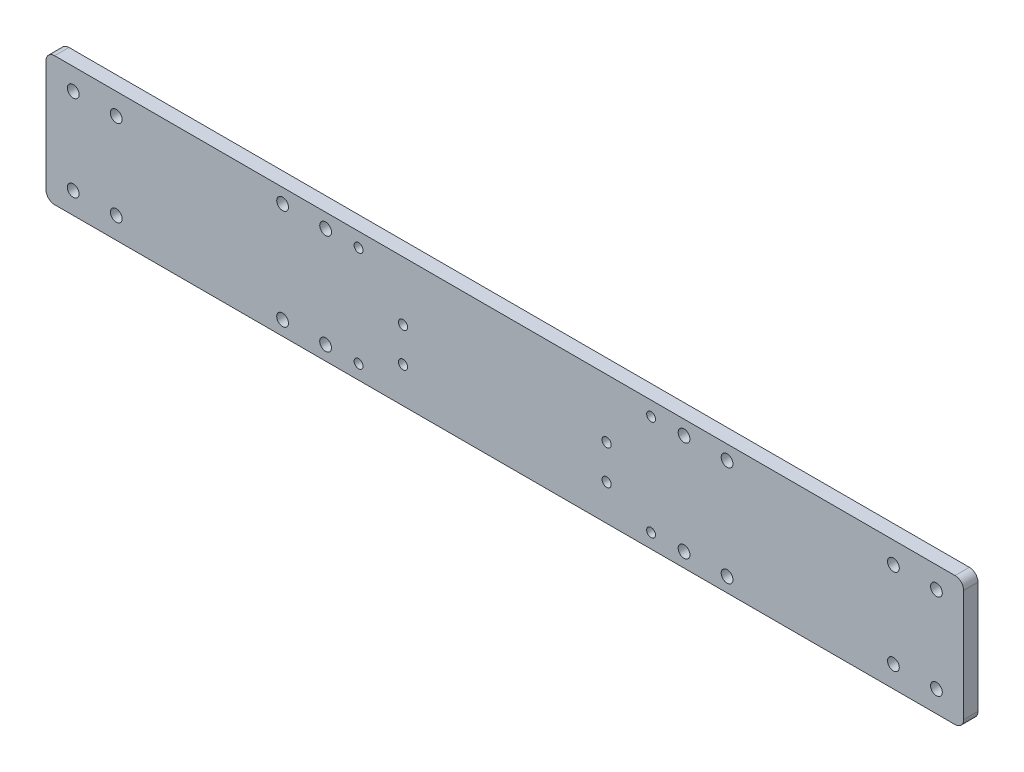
from build123d import *

# Parameters (mm, degrees)
SKETCH_1_R          = 2.05
EXTRUDE_1_DEPTH     = 5
SKETCH_2_R          = 1.55
CUT_EXTRUDE_1_DEPTH = 10
SKETCH_3_R          = 1.6
CUT_EXTRUDE_2_DEPTH = 10
FILLET_1_R          = 3


with BuildPart() as part:
    # Sketch 1 → Extrude 1 (new body)
    with BuildSketch(Plane.XY):
        Polygon((-160, -22.5), (160, -22.5), (160, 22.5), (0, 22.5), (-160, 22.5), align=None)
        with Locations((-77.5, 17.5)):
            Circle(SKETCH_1_R, mode=Mode.SUBTRACT)
        with Locations((-62.5, 17.5)):
            Circle(SKETCH_1_R, mode=Mode.SUBTRACT)
        with Locations((-62.5, -17.5)):
            Circle(SKETCH_1_R, mode=Mode.SUBTRACT)
        with Locations((-77.5, -17.5)):
            Circle(SKETCH_1_R, mode=Mode.SUBTRACT)
        with Locations((-150.5, 15)):
            Circle(SKETCH_1_R, mode=Mode.SUBTRACT)
        with Locations((-135.5, 15)):
            Circle(SKETCH_1_R, mode=Mode.SUBTRACT)
        with Locations((-135.5, -15)):
            Circle(SKETCH_1_R, mode=Mode.SUBTRACT)
        with Locations((-150.5, -15)):
            Circle(SKETCH_1_R, mode=Mode.SUBTRACT)
        with Locations(Location((150.5, 15, 0), (0, 0, 180))):
            Circle(SKETCH_1_R, mode=Mode.SUBTRACT)
        with Locations(Location((150.5, -15, 0), (0, 0, 180))):
            Circle(SKETCH_1_R, mode=Mode.SUBTRACT)
        with Locations(Location((135.5, -15, 0), (0, 0, 180))):
            Circle(SKETCH_1_R, mode=Mode.SUBTRACT)
        with Locations(Location((135.5, 15, 0), (0, 0, 180))):
            Circle(SKETCH_1_R, mode=Mode.SUBTRACT)
        with Locations(Location((62.5, -17.5, 0), (0, 0, 180))):
            Circle(SKETCH_1_R, mode=Mode.SUBTRACT)
        with Locations(Location((77.5, -17.5, 0), (0, 0, 180))):
            Circle(SKETCH_1_R, mode=Mode.SUBTRACT)
        with Locations(Location((62.5, 17.5, 0), (0, 0, 180))):
            Circle(SKETCH_1_R, mode=Mode.SUBTRACT)
        with Locations(Location((77.5, 17.5, 0), (0, 0, 180))):
            Circle(SKETCH_1_R, mode=Mode.SUBTRACT)
    extrude(amount=EXTRUDE_1_DEPTH)

    # Sketch 2 → Cut-Extrude 1 (cut)
    with BuildSketch(Plane.XY.offset(5)):
        with Locations((-51, 17.5)):
            Circle(SKETCH_2_R)
        with Locations((51, 17.5)):
            Circle(SKETCH_2_R)
        with Locations(Location((-51, -17.5, 0), (0, 0, 180))):
            Circle(SKETCH_2_R)
        with Locations(Location((51, -17.5, 0), (0, 0, 180))):
            Circle(SKETCH_2_R)
    extrude(amount=-CUT_EXTRUDE_1_DEPTH, mode=Mode.SUBTRACT)

    # Sketch 3 → Cut-Extrude 2 (cut)
    with BuildSketch(Plane.XY.offset(5)):
        with Locations((-35.5, 2)):
            Circle(SKETCH_3_R)
        with Locations((35.5, 2)):
            Circle(SKETCH_3_R)
        with Locations((35.5, -10)):
            Circle(SKETCH_3_R)
        with Locations((-35.5, -10)):
            Circle(SKETCH_3_R)
    extrude(amount=-CUT_EXTRUDE_2_DEPTH, mode=Mode.SUBTRACT)

    # Fillet 1
    fillet_1_edges = [part.edges().sort_by_distance(p)[0] for p in [
        (160, -22.5, 2.5),
        (-160, -22.5, 2.5),
        (-160, 22.5, 2.5),
        (160, 22.5, 2.5),
    ]]
    fillet(fillet_1_edges, radius=FILLET_1_R)


solid = part.part
